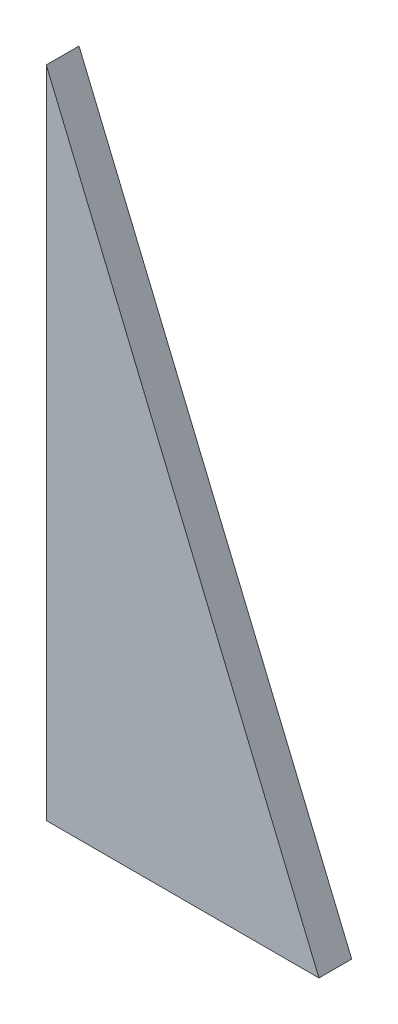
ISO-10303-21;
HEADER;
FILE_DESCRIPTION(('STEP AP214'),'2;1');
FILE_NAME('part.step','',(''),(''),'','','');
FILE_SCHEMA(('AUTOMOTIVE_DESIGN { 1 0 10303 214 1 1 1 1 }'));
ENDSEC;
DATA;
#1=APPLICATION_CONTEXT('core data for automotive mechanical design processes');
#2=APPLICATION_PROTOCOL_DEFINITION('international standard','automotive_design',2000,#1);
#3=PRODUCT_CONTEXT('',#1,'mechanical');
#4=PRODUCT('Part','Part','',(#3));
#5=PRODUCT_RELATED_PRODUCT_CATEGORY('part','',(#4));
#6=PRODUCT_DEFINITION_FORMATION('','',#4);
#7=PRODUCT_DEFINITION_CONTEXT('part definition',#1,'design');
#8=PRODUCT_DEFINITION('design','',#6,#7);
#9=PRODUCT_DEFINITION_SHAPE('','',#8);
#10=(LENGTH_UNIT() NAMED_UNIT(*) SI_UNIT(.MILLI.,.METRE.));
#11=(NAMED_UNIT(*) PLANE_ANGLE_UNIT() SI_UNIT($,.RADIAN.));
#12=(NAMED_UNIT(*) SI_UNIT($,.STERADIAN.) SOLID_ANGLE_UNIT());
#13=UNCERTAINTY_MEASURE_WITH_UNIT(LENGTH_MEASURE(1.E-05),#10,'distance_accuracy_value','');
#14=(GEOMETRIC_REPRESENTATION_CONTEXT(3) GLOBAL_UNCERTAINTY_ASSIGNED_CONTEXT((#13)) GLOBAL_UNIT_ASSIGNED_CONTEXT((#10,
#11,#12)) REPRESENTATION_CONTEXT('',''));
#15=CARTESIAN_POINT('',(0.,0.,0.));
#16=DIRECTION('',(0.,0.,1.));
#17=DIRECTION('',(1.,0.,0.));
#18=AXIS2_PLACEMENT_3D('',#15,#16,#17);
#19=CARTESIAN_POINT('',(30.,100.,12.));
#20=DIRECTION('',(0.,0.,1.));
#21=DIRECTION('',(1.,0.,0.));
#22=AXIS2_PLACEMENT_3D('',#19,#20,#21);
#23=PLANE('',#22);
#24=DIRECTION('',(1.,0.,0.));
#25=VECTOR('',#24,1.);
#26=CARTESIAN_POINT('',(0.,0.,12.));
#27=LINE('',#26,#25);
#28=CARTESIAN_POINT('',(0.,0.,12.));
#29=VERTEX_POINT('',#28);
#30=CARTESIAN_POINT('',(100.,0.,12.));
#31=VERTEX_POINT('',#30);
#32=EDGE_CURVE('E72',#29,#31,#27,.T.);
#33=ORIENTED_EDGE('',*,*,#32,.T.);
#34=DIRECTION('',(-0.38461538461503,0.923076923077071,0.));
#35=VECTOR('',#34,1.);
#36=CARTESIAN_POINT('',(100.,0.,12.));
#37=LINE('',#36,#35);
#38=CARTESIAN_POINT('',(0.,240.,12.));
#39=VERTEX_POINT('',#38);
#40=EDGE_CURVE('E65',#31,#39,#37,.T.);
#41=ORIENTED_EDGE('',*,*,#40,.T.);
#42=DIRECTION('',(0.,-1.,0.));
#43=VECTOR('',#42,1.);
#44=CARTESIAN_POINT('',(0.,240.,12.));
#45=LINE('',#44,#43);
#46=EDGE_CURVE('E10',#39,#29,#45,.T.);
#47=ORIENTED_EDGE('',*,*,#46,.T.);
#48=EDGE_LOOP('',(#33,#41,#47));
#49=FACE_BOUND('',#48,.T.);
#50=ADVANCED_FACE('F16',(#49),#23,.T.);
#51=CARTESIAN_POINT('',(30.,100.,0.));
#52=DIRECTION('',(0.,0.,1.));
#53=DIRECTION('',(1.,0.,0.));
#54=AXIS2_PLACEMENT_3D('',#51,#52,#53);
#55=PLANE('',#54);
#56=DIRECTION('',(0.,-1.,0.));
#57=VECTOR('',#56,1.);
#58=CARTESIAN_POINT('',(0.,240.,0.));
#59=LINE('',#58,#57);
#60=CARTESIAN_POINT('',(0.,240.,0.));
#61=VERTEX_POINT('',#60);
#62=CARTESIAN_POINT('',(0.,0.,0.));
#63=VERTEX_POINT('',#62);
#64=EDGE_CURVE('E24',#61,#63,#59,.T.);
#65=ORIENTED_EDGE('',*,*,#64,.F.);
#66=DIRECTION('',(-0.38461538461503,0.923076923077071,0.));
#67=VECTOR('',#66,1.);
#68=CARTESIAN_POINT('',(100.,0.,0.));
#69=LINE('',#68,#67);
#70=CARTESIAN_POINT('',(100.,0.,0.));
#71=VERTEX_POINT('',#70);
#72=EDGE_CURVE('E74',#71,#61,#69,.T.);
#73=ORIENTED_EDGE('',*,*,#72,.F.);
#74=DIRECTION('',(1.,0.,0.));
#75=VECTOR('',#74,1.);
#76=CARTESIAN_POINT('',(0.,0.,0.));
#77=LINE('',#76,#75);
#78=EDGE_CURVE('E70',#63,#71,#77,.T.);
#79=ORIENTED_EDGE('',*,*,#78,.F.);
#80=EDGE_LOOP('',(#65,#73,#79));
#81=FACE_BOUND('',#80,.T.);
#82=ADVANCED_FACE('F76',(#81),#55,.F.);
#83=CARTESIAN_POINT('',(0.,240.,0.));
#84=DIRECTION('',(1.,0.,0.));
#85=DIRECTION('',(0.,1.,0.));
#86=AXIS2_PLACEMENT_3D('',#83,#84,#85);
#87=PLANE('',#86);
#88=ORIENTED_EDGE('',*,*,#64,.T.);
#89=DIRECTION('',(0.,0.,1.));
#90=VECTOR('',#89,1.);
#91=CARTESIAN_POINT('',(0.,0.,0.));
#92=LINE('',#91,#90);
#93=EDGE_CURVE('E59',#63,#29,#92,.T.);
#94=ORIENTED_EDGE('',*,*,#93,.T.);
#95=ORIENTED_EDGE('',*,*,#46,.F.);
#96=DIRECTION('',(0.,0.,1.));
#97=VECTOR('',#96,1.);
#98=CARTESIAN_POINT('',(0.,240.,0.));
#99=LINE('',#98,#97);
#100=EDGE_CURVE('E62',#61,#39,#99,.T.);
#101=ORIENTED_EDGE('',*,*,#100,.F.);
#102=EDGE_LOOP('',(#88,#94,#95,#101));
#103=FACE_BOUND('',#102,.T.);
#104=ADVANCED_FACE('F58',(#103),#87,.F.);
#105=CARTESIAN_POINT('',(100.,0.,0.));
#106=DIRECTION('',(-0.923076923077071,-0.38461538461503,0.));
#107=DIRECTION('',(-0.38461538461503,0.923076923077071,0.));
#108=AXIS2_PLACEMENT_3D('',#105,#106,#107);
#109=PLANE('',#108);
#110=ORIENTED_EDGE('',*,*,#72,.T.);
#111=ORIENTED_EDGE('',*,*,#100,.T.);
#112=ORIENTED_EDGE('',*,*,#40,.F.);
#113=DIRECTION('',(0.,0.,1.));
#114=VECTOR('',#113,1.);
#115=CARTESIAN_POINT('',(100.,0.,0.));
#116=LINE('',#115,#114);
#117=EDGE_CURVE('E79',#71,#31,#116,.T.);
#118=ORIENTED_EDGE('',*,*,#117,.F.);
#119=EDGE_LOOP('',(#110,#111,#112,#118));
#120=FACE_BOUND('',#119,.T.);
#121=ADVANCED_FACE('F95',(#120),#109,.F.);
#122=CARTESIAN_POINT('',(0.,0.,0.));
#123=DIRECTION('',(0.,1.,0.));
#124=DIRECTION('',(1.,0.,0.));
#125=AXIS2_PLACEMENT_3D('',#122,#123,#124);
#126=PLANE('',#125);
#127=ORIENTED_EDGE('',*,*,#78,.T.);
#128=ORIENTED_EDGE('',*,*,#117,.T.);
#129=ORIENTED_EDGE('',*,*,#32,.F.);
#130=ORIENTED_EDGE('',*,*,#93,.F.);
#131=EDGE_LOOP('',(#127,#128,#129,#130));
#132=FACE_BOUND('',#131,.T.);
#133=ADVANCED_FACE('F68',(#132),#126,.F.);
#134=CLOSED_SHELL('',(#50,#82,#104,#121,#133));
#135=MANIFOLD_SOLID_BREP('B1',#134);
#136=ADVANCED_BREP_SHAPE_REPRESENTATION('',(#18,#135),#14);
#137=SHAPE_DEFINITION_REPRESENTATION(#9,#136);
ENDSEC;
END-ISO-10303-21;
